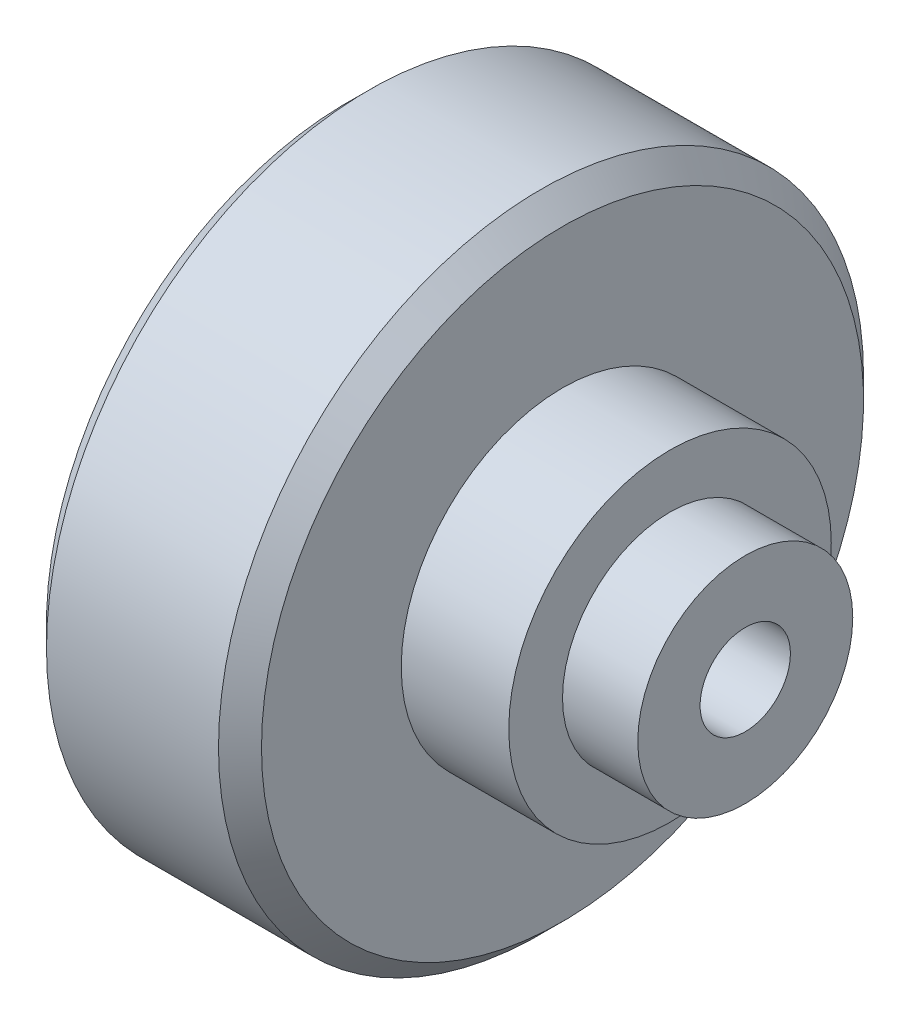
from build123d import *

# Parameters (mm, degrees)
CHAMFER1_SIZE         = 1
M5_TAPPED_HOLE1_D     = 4.2
M5_TAPPED_HOLE1_DEPTH = 18.5
M5_TAPPED_HOLE1_TIP   = 1.2618073


with BuildPart() as part:
    # Sketch1 → Revolve1 (revolve)
    with BuildSketch(Plane(origin=(0, 0, 0), x_dir=(1, 0, 0), z_dir=(0, 1, 0)), mode=Mode.PRIVATE) as revolve1_sk:
        Polygon((0, 0), (18.5, 0), (18.5, 5), (15, 5), (15, 7.5), (10, 7.5), (10, 15), (0, 15), align=None)
    revolve(revolve1_sk.sketch.rotate(Axis((0, 0, 0), (1, 0, 0)), 180), axis=Axis((0, 0, 0), (1, 0, 0)))

    # Chamfer1
    chamfer1_edges = [part.edges().sort_by_distance(p)[0] for p in [
        (10, 0, -15),
        (0, 0, -15),
    ]]
    chamfer(chamfer1_edges, length=CHAMFER1_SIZE)

    # M5 Tapped Hole1
    with Locations(Plane(origin=(18.5, 0, 0), x_dir=(0, 0, 1), z_dir=(1, 0, 0))):
        with Locations((0, 0)):
            Hole(M5_TAPPED_HOLE1_D / 2, depth=M5_TAPPED_HOLE1_DEPTH)
            with Locations((0, 0, -(M5_TAPPED_HOLE1_DEPTH + M5_TAPPED_HOLE1_TIP / 2))):  # 118° drill point
                Cone(0, M5_TAPPED_HOLE1_D / 2, M5_TAPPED_HOLE1_TIP, mode=Mode.SUBTRACT)


solid = part.part
